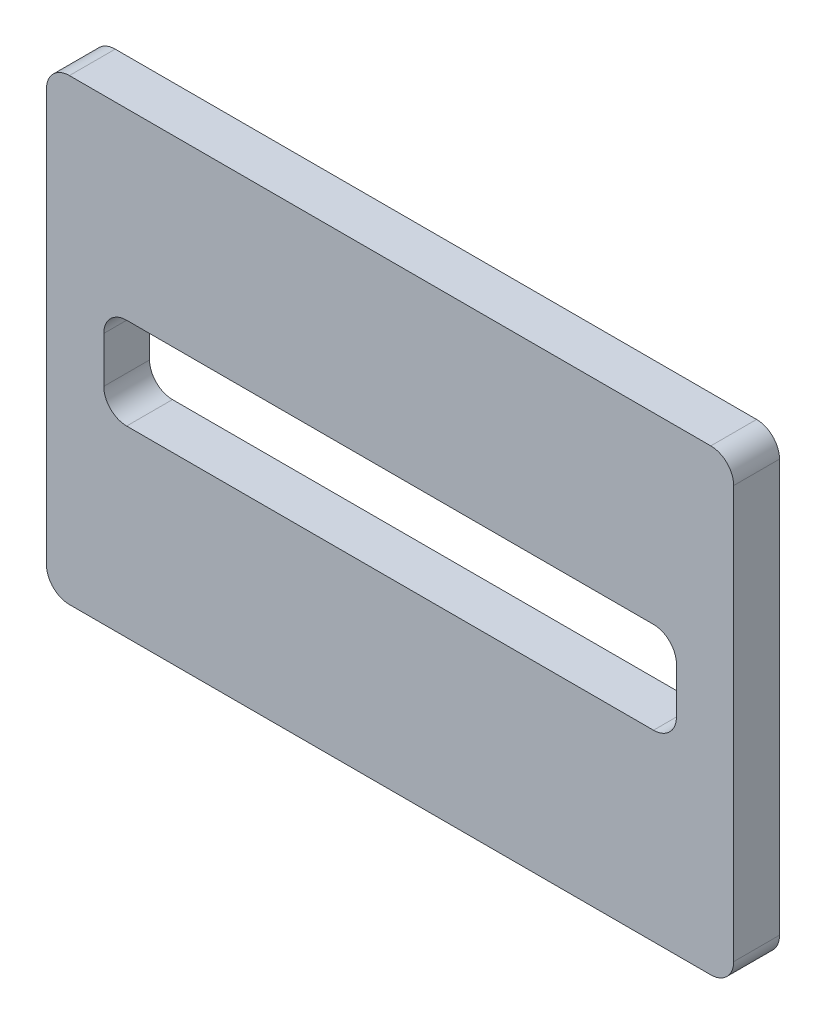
ISO-10303-21;
HEADER;
FILE_DESCRIPTION(('STEP AP214'),'2;1');
FILE_NAME('part.step','',(''),(''),'','','');
FILE_SCHEMA(('AUTOMOTIVE_DESIGN { 1 0 10303 214 1 1 1 1 }'));
ENDSEC;
DATA;
#1=APPLICATION_CONTEXT('core data for automotive mechanical design processes');
#2=APPLICATION_PROTOCOL_DEFINITION('international standard','automotive_design',2000,#1);
#3=PRODUCT_CONTEXT('',#1,'mechanical');
#4=PRODUCT('Part','Part','',(#3));
#5=PRODUCT_RELATED_PRODUCT_CATEGORY('part','',(#4));
#6=PRODUCT_DEFINITION_FORMATION('','',#4);
#7=PRODUCT_DEFINITION_CONTEXT('part definition',#1,'design');
#8=PRODUCT_DEFINITION('design','',#6,#7);
#9=PRODUCT_DEFINITION_SHAPE('','',#8);
#10=(LENGTH_UNIT() NAMED_UNIT(*) SI_UNIT(.MILLI.,.METRE.));
#11=(NAMED_UNIT(*) PLANE_ANGLE_UNIT() SI_UNIT($,.RADIAN.));
#12=(NAMED_UNIT(*) SI_UNIT($,.STERADIAN.) SOLID_ANGLE_UNIT());
#13=UNCERTAINTY_MEASURE_WITH_UNIT(LENGTH_MEASURE(1.E-05),#10,'distance_accuracy_value','');
#14=(GEOMETRIC_REPRESENTATION_CONTEXT(3) GLOBAL_UNCERTAINTY_ASSIGNED_CONTEXT((#13)) GLOBAL_UNIT_ASSIGNED_CONTEXT((#10,
#11,#12)) REPRESENTATION_CONTEXT('',''));
#15=CARTESIAN_POINT('',(0.,0.,0.));
#16=DIRECTION('',(0.,0.,1.));
#17=DIRECTION('',(1.,0.,0.));
#18=AXIS2_PLACEMENT_3D('',#15,#16,#17);
#19=CARTESIAN_POINT('',(0.,0.,20.));
#20=DIRECTION('',(1.,0.,0.));
#21=DIRECTION('',(0.,0.,-1.));
#22=AXIS2_PLACEMENT_3D('',#19,#20,#21);
#23=PLANE('',#22);
#24=DIRECTION('',(0.,-1.,0.));
#25=VECTOR('',#24,1.);
#26=CARTESIAN_POINT('',(0.,0.,20.));
#27=LINE('',#26,#25);
#28=CARTESIAN_POINT('',(0.,190.,20.));
#29=VERTEX_POINT('',#28);
#30=CARTESIAN_POINT('',(0.,10.,20.));
#31=VERTEX_POINT('',#30);
#32=EDGE_CURVE('E277',#29,#31,#27,.T.);
#33=ORIENTED_EDGE('',*,*,#32,.F.);
#34=DIRECTION('',(0.,0.,-1.));
#35=VECTOR('',#34,1.);
#36=CARTESIAN_POINT('',(0.,190.,20.));
#37=LINE('',#36,#35);
#38=CARTESIAN_POINT('',(0.,190.,0.));
#39=VERTEX_POINT('',#38);
#40=EDGE_CURVE('E333',#29,#39,#37,.T.);
#41=ORIENTED_EDGE('',*,*,#40,.T.);
#42=DIRECTION('',(0.,-1.,0.));
#43=VECTOR('',#42,1.);
#44=CARTESIAN_POINT('',(0.,0.,0.));
#45=LINE('',#44,#43);
#46=CARTESIAN_POINT('',(0.,10.,0.));
#47=VERTEX_POINT('',#46);
#48=EDGE_CURVE('E241',#39,#47,#45,.T.);
#49=ORIENTED_EDGE('',*,*,#48,.T.);
#50=DIRECTION('',(0.,0.,-1.));
#51=VECTOR('',#50,1.);
#52=CARTESIAN_POINT('',(0.,10.,20.));
#53=LINE('',#52,#51);
#54=EDGE_CURVE('E331',#47,#31,#53,.F.);
#55=ORIENTED_EDGE('',*,*,#54,.T.);
#56=EDGE_LOOP('',(#33,#41,#49,#55));
#57=FACE_BOUND('',#56,.T.);
#58=ADVANCED_FACE('F37',(#57),#23,.F.);
#59=CARTESIAN_POINT('',(0.,0.,20.));
#60=DIRECTION('',(0.,1.,0.));
#61=DIRECTION('',(0.,0.,1.));
#62=AXIS2_PLACEMENT_3D('',#59,#60,#61);
#63=PLANE('',#62);
#64=DIRECTION('',(1.,0.,0.));
#65=VECTOR('',#64,1.);
#66=CARTESIAN_POINT('',(0.,0.,0.));
#67=LINE('',#66,#65);
#68=CARTESIAN_POINT('',(10.,0.,0.));
#69=VERTEX_POINT('',#68);
#70=CARTESIAN_POINT('',(290.,0.,0.));
#71=VERTEX_POINT('',#70);
#72=EDGE_CURVE('E293',#69,#71,#67,.T.);
#73=ORIENTED_EDGE('',*,*,#72,.T.);
#74=DIRECTION('',(0.,0.,-1.));
#75=VECTOR('',#74,1.);
#76=CARTESIAN_POINT('',(290.,0.,20.));
#77=LINE('',#76,#75);
#78=CARTESIAN_POINT('',(290.,0.,20.));
#79=VERTEX_POINT('',#78);
#80=EDGE_CURVE('E316',#71,#79,#77,.F.);
#81=ORIENTED_EDGE('',*,*,#80,.T.);
#82=DIRECTION('',(1.,0.,0.));
#83=VECTOR('',#82,1.);
#84=CARTESIAN_POINT('',(0.,0.,20.));
#85=LINE('',#84,#83);
#86=CARTESIAN_POINT('',(10.,0.,20.));
#87=VERTEX_POINT('',#86);
#88=EDGE_CURVE('E280',#87,#79,#85,.T.);
#89=ORIENTED_EDGE('',*,*,#88,.F.);
#90=DIRECTION('',(0.,0.,-1.));
#91=VECTOR('',#90,1.);
#92=CARTESIAN_POINT('',(10.,0.,20.));
#93=LINE('',#92,#91);
#94=EDGE_CURVE('E313',#87,#69,#93,.T.);
#95=ORIENTED_EDGE('',*,*,#94,.T.);
#96=EDGE_LOOP('',(#73,#81,#89,#95));
#97=FACE_BOUND('',#96,.T.);
#98=ADVANCED_FACE('F429',(#97),#63,.F.);
#99=CARTESIAN_POINT('',(300.,0.,20.));
#100=DIRECTION('',(-1.,0.,0.));
#101=DIRECTION('',(0.,0.,1.));
#102=AXIS2_PLACEMENT_3D('',#99,#100,#101);
#103=PLANE('',#102);
#104=DIRECTION('',(0.,1.,0.));
#105=VECTOR('',#104,1.);
#106=CARTESIAN_POINT('',(300.,0.,20.));
#107=LINE('',#106,#105);
#108=CARTESIAN_POINT('',(300.,10.,20.));
#109=VERTEX_POINT('',#108);
#110=CARTESIAN_POINT('',(300.,190.,20.));
#111=VERTEX_POINT('',#110);
#112=EDGE_CURVE('E284',#109,#111,#107,.T.);
#113=ORIENTED_EDGE('',*,*,#112,.F.);
#114=DIRECTION('',(0.,0.,-1.));
#115=VECTOR('',#114,1.);
#116=CARTESIAN_POINT('',(300.,10.,20.));
#117=LINE('',#116,#115);
#118=CARTESIAN_POINT('',(300.,10.,0.));
#119=VERTEX_POINT('',#118);
#120=EDGE_CURVE('E302',#109,#119,#117,.T.);
#121=ORIENTED_EDGE('',*,*,#120,.T.);
#122=DIRECTION('',(0.,1.,0.));
#123=VECTOR('',#122,1.);
#124=CARTESIAN_POINT('',(300.,0.,0.));
#125=LINE('',#124,#123);
#126=CARTESIAN_POINT('',(300.,190.,0.));
#127=VERTEX_POINT('',#126);
#128=EDGE_CURVE('E296',#119,#127,#125,.T.);
#129=ORIENTED_EDGE('',*,*,#128,.T.);
#130=DIRECTION('',(0.,0.,-1.));
#131=VECTOR('',#130,1.);
#132=CARTESIAN_POINT('',(300.,190.,20.));
#133=LINE('',#132,#131);
#134=EDGE_CURVE('E290',#127,#111,#133,.F.);
#135=ORIENTED_EDGE('',*,*,#134,.T.);
#136=EDGE_LOOP('',(#113,#121,#129,#135));
#137=FACE_BOUND('',#136,.T.);
#138=ADVANCED_FACE('F435',(#137),#103,.F.);
#139=CARTESIAN_POINT('',(0.,200.,20.));
#140=DIRECTION('',(0.,-1.,0.));
#141=DIRECTION('',(0.,0.,-1.));
#142=AXIS2_PLACEMENT_3D('',#139,#140,#141);
#143=PLANE('',#142);
#144=DIRECTION('',(-1.,0.,0.));
#145=VECTOR('',#144,1.);
#146=CARTESIAN_POINT('',(0.,200.,20.));
#147=LINE('',#146,#145);
#148=CARTESIAN_POINT('',(290.,200.,20.));
#149=VERTEX_POINT('',#148);
#150=CARTESIAN_POINT('',(10.,200.,20.));
#151=VERTEX_POINT('',#150);
#152=EDGE_CURVE('E287',#149,#151,#147,.T.);
#153=ORIENTED_EDGE('',*,*,#152,.F.);
#154=DIRECTION('',(0.,0.,-1.));
#155=VECTOR('',#154,1.);
#156=CARTESIAN_POINT('',(290.,200.,20.));
#157=LINE('',#156,#155);
#158=CARTESIAN_POINT('',(290.,200.,0.));
#159=VERTEX_POINT('',#158);
#160=EDGE_CURVE('E328',#149,#159,#157,.T.);
#161=ORIENTED_EDGE('',*,*,#160,.T.);
#162=DIRECTION('',(-1.,0.,0.));
#163=VECTOR('',#162,1.);
#164=CARTESIAN_POINT('',(0.,200.,0.));
#165=LINE('',#164,#163);
#166=CARTESIAN_POINT('',(10.,200.,0.));
#167=VERTEX_POINT('',#166);
#168=EDGE_CURVE('E281',#159,#167,#165,.T.);
#169=ORIENTED_EDGE('',*,*,#168,.T.);
#170=DIRECTION('',(0.,0.,-1.));
#171=VECTOR('',#170,1.);
#172=CARTESIAN_POINT('',(10.,200.,20.));
#173=LINE('',#172,#171);
#174=EDGE_CURVE('E326',#167,#151,#173,.F.);
#175=ORIENTED_EDGE('',*,*,#174,.T.);
#176=EDGE_LOOP('',(#153,#161,#169,#175));
#177=FACE_BOUND('',#176,.T.);
#178=ADVANCED_FACE('F526',(#177),#143,.F.);
#179=CARTESIAN_POINT('',(0.,0.,20.));
#180=DIRECTION('',(0.,0.,-1.));
#181=DIRECTION('',(-1.,0.,0.));
#182=AXIS2_PLACEMENT_3D('',#179,#180,#181);
#183=PLANE('',#182);
#184=DIRECTION('',(0.,-1.,0.));
#185=VECTOR('',#184,1.);
#186=CARTESIAN_POINT('',(275.,120.,20.));
#187=LINE('',#186,#185);
#188=CARTESIAN_POINT('',(275.,110.,20.));
#189=VERTEX_POINT('',#188);
#190=CARTESIAN_POINT('',(275.,90.,20.));
#191=VERTEX_POINT('',#190);
#192=EDGE_CURVE('E385',#189,#191,#187,.T.);
#193=ORIENTED_EDGE('',*,*,#192,.T.);
#194=CARTESIAN_POINT('',(265.,90.,20.));
#195=DIRECTION('',(0.,0.,-1.));
#196=DIRECTION('',(-1.,0.,0.));
#197=AXIS2_PLACEMENT_3D('',#194,#195,#196);
#198=CIRCLE('',#197,10.);
#199=CARTESIAN_POINT('',(265.,80.,20.));
#200=VERTEX_POINT('',#199);
#201=EDGE_CURVE('E365',#191,#200,#198,.T.);
#202=ORIENTED_EDGE('',*,*,#201,.T.);
#203=DIRECTION('',(-1.,0.,0.));
#204=VECTOR('',#203,1.);
#205=CARTESIAN_POINT('',(24.9999999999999,80.,20.));
#206=LINE('',#205,#204);
#207=CARTESIAN_POINT('',(34.9999999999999,80.,20.));
#208=VERTEX_POINT('',#207);
#209=EDGE_CURVE('E262',#200,#208,#206,.T.);
#210=ORIENTED_EDGE('',*,*,#209,.T.);
#211=CARTESIAN_POINT('',(34.9999999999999,90.,20.));
#212=DIRECTION('',(0.,0.,-1.));
#213=DIRECTION('',(-1.,0.,0.));
#214=AXIS2_PLACEMENT_3D('',#211,#212,#213);
#215=CIRCLE('',#214,10.);
#216=CARTESIAN_POINT('',(24.9999999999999,90.,20.));
#217=VERTEX_POINT('',#216);
#218=EDGE_CURVE('E357',#208,#217,#215,.T.);
#219=ORIENTED_EDGE('',*,*,#218,.T.);
#220=DIRECTION('',(0.,1.,0.));
#221=VECTOR('',#220,1.);
#222=CARTESIAN_POINT('',(24.9999999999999,120.,20.));
#223=LINE('',#222,#221);
#224=CARTESIAN_POINT('',(24.9999999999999,110.,20.));
#225=VERTEX_POINT('',#224);
#226=EDGE_CURVE('E391',#217,#225,#223,.T.);
#227=ORIENTED_EDGE('',*,*,#226,.T.);
#228=CARTESIAN_POINT('',(34.9999999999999,110.,20.));
#229=DIRECTION('',(0.,0.,-1.));
#230=DIRECTION('',(-1.,0.,0.));
#231=AXIS2_PLACEMENT_3D('',#228,#229,#230);
#232=CIRCLE('',#231,10.);
#233=CARTESIAN_POINT('',(34.9999999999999,120.,20.));
#234=VERTEX_POINT('',#233);
#235=EDGE_CURVE('E361',#225,#234,#232,.T.);
#236=ORIENTED_EDGE('',*,*,#235,.T.);
#237=DIRECTION('',(1.,0.,0.));
#238=VECTOR('',#237,1.);
#239=CARTESIAN_POINT('',(24.9999999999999,120.,20.));
#240=LINE('',#239,#238);
#241=CARTESIAN_POINT('',(265.,120.,20.));
#242=VERTEX_POINT('',#241);
#243=EDGE_CURVE('E387',#234,#242,#240,.T.);
#244=ORIENTED_EDGE('',*,*,#243,.T.);
#245=CARTESIAN_POINT('',(265.,110.,20.));
#246=DIRECTION('',(0.,0.,-1.));
#247=DIRECTION('',(-1.,0.,0.));
#248=AXIS2_PLACEMENT_3D('',#245,#246,#247);
#249=CIRCLE('',#248,10.);
#250=EDGE_CURVE('E11',#242,#189,#249,.T.);
#251=ORIENTED_EDGE('',*,*,#250,.T.);
#252=EDGE_LOOP('',(#193,#202,#210,#219,#227,#236,#244,#251));
#253=FACE_BOUND('',#252,.T.);
#254=ORIENTED_EDGE('',*,*,#88,.T.);
#255=CARTESIAN_POINT('',(290.,10.,20.));
#256=DIRECTION('',(0.,0.,-1.));
#257=DIRECTION('',(-1.,0.,0.));
#258=AXIS2_PLACEMENT_3D('',#255,#256,#257);
#259=CIRCLE('',#258,10.);
#260=EDGE_CURVE('E324',#79,#109,#259,.F.);
#261=ORIENTED_EDGE('',*,*,#260,.T.);
#262=ORIENTED_EDGE('',*,*,#112,.T.);
#263=CARTESIAN_POINT('',(290.,190.,20.));
#264=DIRECTION('',(0.,0.,-1.));
#265=DIRECTION('',(-1.,0.,0.));
#266=AXIS2_PLACEMENT_3D('',#263,#264,#265);
#267=CIRCLE('',#266,10.);
#268=EDGE_CURVE('E322',#111,#149,#267,.F.);
#269=ORIENTED_EDGE('',*,*,#268,.T.);
#270=ORIENTED_EDGE('',*,*,#152,.T.);
#271=CARTESIAN_POINT('',(10.,190.,20.));
#272=DIRECTION('',(0.,0.,-1.));
#273=DIRECTION('',(-1.,0.,0.));
#274=AXIS2_PLACEMENT_3D('',#271,#272,#273);
#275=CIRCLE('',#274,10.);
#276=EDGE_CURVE('E320',#151,#29,#275,.F.);
#277=ORIENTED_EDGE('',*,*,#276,.T.);
#278=ORIENTED_EDGE('',*,*,#32,.T.);
#279=CARTESIAN_POINT('',(10.,10.,20.));
#280=DIRECTION('',(0.,0.,-1.));
#281=DIRECTION('',(-1.,0.,0.));
#282=AXIS2_PLACEMENT_3D('',#279,#280,#281);
#283=CIRCLE('',#282,10.);
#284=EDGE_CURVE('E318',#31,#87,#283,.F.);
#285=ORIENTED_EDGE('',*,*,#284,.T.);
#286=EDGE_LOOP('',(#254,#261,#262,#269,#270,#277,#278,#285));
#287=FACE_BOUND('',#286,.T.);
#288=ADVANCED_FACE('F403',(#253,#287),#183,.F.);
#289=CARTESIAN_POINT('',(0.,0.,0.));
#290=DIRECTION('',(0.,0.,-1.));
#291=DIRECTION('',(-1.,0.,0.));
#292=AXIS2_PLACEMENT_3D('',#289,#290,#291);
#293=PLANE('',#292);
#294=DIRECTION('',(0.,1.,0.));
#295=VECTOR('',#294,1.);
#296=CARTESIAN_POINT('',(24.9999999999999,120.,0.));
#297=LINE('',#296,#295);
#298=CARTESIAN_POINT('',(24.9999999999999,90.,0.));
#299=VERTEX_POINT('',#298);
#300=CARTESIAN_POINT('',(24.9999999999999,110.,0.));
#301=VERTEX_POINT('',#300);
#302=EDGE_CURVE('E382',#299,#301,#297,.T.);
#303=ORIENTED_EDGE('',*,*,#302,.F.);
#304=CARTESIAN_POINT('',(34.9999999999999,90.,0.));
#305=DIRECTION('',(0.,0.,-1.));
#306=DIRECTION('',(-1.,0.,0.));
#307=AXIS2_PLACEMENT_3D('',#304,#305,#306);
#308=CIRCLE('',#307,10.);
#309=CARTESIAN_POINT('',(34.9999999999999,80.,0.));
#310=VERTEX_POINT('',#309);
#311=EDGE_CURVE('E355',#299,#310,#308,.F.);
#312=ORIENTED_EDGE('',*,*,#311,.T.);
#313=DIRECTION('',(-1.,0.,0.));
#314=VECTOR('',#313,1.);
#315=CARTESIAN_POINT('',(24.9999999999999,80.,0.));
#316=LINE('',#315,#314);
#317=CARTESIAN_POINT('',(265.,80.,0.));
#318=VERTEX_POINT('',#317);
#319=EDGE_CURVE('E228',#318,#310,#316,.T.);
#320=ORIENTED_EDGE('',*,*,#319,.F.);
#321=CARTESIAN_POINT('',(265.,90.,0.));
#322=DIRECTION('',(0.,0.,-1.));
#323=DIRECTION('',(-1.,0.,0.));
#324=AXIS2_PLACEMENT_3D('',#321,#322,#323);
#325=CIRCLE('',#324,10.);
#326=CARTESIAN_POINT('',(275.,90.,0.));
#327=VERTEX_POINT('',#326);
#328=EDGE_CURVE('E363',#318,#327,#325,.F.);
#329=ORIENTED_EDGE('',*,*,#328,.T.);
#330=DIRECTION('',(0.,-1.,0.));
#331=VECTOR('',#330,1.);
#332=CARTESIAN_POINT('',(275.,120.,0.));
#333=LINE('',#332,#331);
#334=CARTESIAN_POINT('',(275.,110.,0.));
#335=VERTEX_POINT('',#334);
#336=EDGE_CURVE('E374',#335,#327,#333,.T.);
#337=ORIENTED_EDGE('',*,*,#336,.F.);
#338=CARTESIAN_POINT('',(265.,110.,0.));
#339=DIRECTION('',(0.,0.,-1.));
#340=DIRECTION('',(-1.,0.,0.));
#341=AXIS2_PLACEMENT_3D('',#338,#339,#340);
#342=CIRCLE('',#341,10.);
#343=CARTESIAN_POINT('',(265.,120.,0.));
#344=VERTEX_POINT('',#343);
#345=EDGE_CURVE('E45',#335,#344,#342,.F.);
#346=ORIENTED_EDGE('',*,*,#345,.T.);
#347=DIRECTION('',(1.,0.,0.));
#348=VECTOR('',#347,1.);
#349=CARTESIAN_POINT('',(24.9999999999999,120.,0.));
#350=LINE('',#349,#348);
#351=CARTESIAN_POINT('',(34.9999999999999,120.,0.));
#352=VERTEX_POINT('',#351);
#353=EDGE_CURVE('E373',#352,#344,#350,.T.);
#354=ORIENTED_EDGE('',*,*,#353,.F.);
#355=CARTESIAN_POINT('',(34.9999999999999,110.,0.));
#356=DIRECTION('',(0.,0.,-1.));
#357=DIRECTION('',(-1.,0.,0.));
#358=AXIS2_PLACEMENT_3D('',#355,#356,#357);
#359=CIRCLE('',#358,10.);
#360=EDGE_CURVE('E359',#352,#301,#359,.F.);
#361=ORIENTED_EDGE('',*,*,#360,.T.);
#362=EDGE_LOOP('',(#303,#312,#320,#329,#337,#346,#354,#361));
#363=FACE_BOUND('',#362,.T.);
#364=DIRECTION('',(0.,1.,0.));
#365=VECTOR('',#364,1.);
#366=CARTESIAN_POINT('',(25.,30.,0.));
#367=LINE('',#366,#365);
#368=CARTESIAN_POINT('',(25.,30.,0.));
#369=VERTEX_POINT('',#368);
#370=CARTESIAN_POINT('',(25.,41.,0.));
#371=VERTEX_POINT('',#370);
#372=EDGE_CURVE('E205',#369,#371,#367,.T.);
#373=ORIENTED_EDGE('',*,*,#372,.F.);
#374=DIRECTION('',(-1.,0.,0.));
#375=VECTOR('',#374,1.);
#376=CARTESIAN_POINT('',(25.,30.,0.));
#377=LINE('',#376,#375);
#378=CARTESIAN_POINT('',(275.,30.,0.));
#379=VERTEX_POINT('',#378);
#380=EDGE_CURVE('E222',#379,#369,#377,.T.);
#381=ORIENTED_EDGE('',*,*,#380,.F.);
#382=DIRECTION('',(0.,-1.,0.));
#383=VECTOR('',#382,1.);
#384=CARTESIAN_POINT('',(275.,30.,0.));
#385=LINE('',#384,#383);
#386=CARTESIAN_POINT('',(275.,41.,0.));
#387=VERTEX_POINT('',#386);
#388=EDGE_CURVE('E225',#387,#379,#385,.T.);
#389=ORIENTED_EDGE('',*,*,#388,.F.);
#390=DIRECTION('',(1.,0.,0.));
#391=VECTOR('',#390,1.);
#392=CARTESIAN_POINT('',(25.,41.,0.));
#393=LINE('',#392,#391);
#394=EDGE_CURVE('E234',#371,#387,#393,.T.);
#395=ORIENTED_EDGE('',*,*,#394,.F.);
#396=EDGE_LOOP('',(#373,#381,#389,#395));
#397=FACE_BOUND('',#396,.T.);
#398=DIRECTION('',(0.,1.,0.));
#399=VECTOR('',#398,1.);
#400=CARTESIAN_POINT('',(25.,170.,0.));
#401=LINE('',#400,#399);
#402=CARTESIAN_POINT('',(25.,159.,0.));
#403=VERTEX_POINT('',#402);
#404=CARTESIAN_POINT('',(25.,170.,0.));
#405=VERTEX_POINT('',#404);
#406=EDGE_CURVE('E259',#403,#405,#401,.T.);
#407=ORIENTED_EDGE('',*,*,#406,.F.);
#408=DIRECTION('',(-1.,0.,0.));
#409=VECTOR('',#408,1.);
#410=CARTESIAN_POINT('',(25.,159.,0.));
#411=LINE('',#410,#409);
#412=CARTESIAN_POINT('',(275.,159.,0.));
#413=VERTEX_POINT('',#412);
#414=EDGE_CURVE('E249',#413,#403,#411,.T.);
#415=ORIENTED_EDGE('',*,*,#414,.F.);
#416=DIRECTION('',(0.,-1.,0.));
#417=VECTOR('',#416,1.);
#418=CARTESIAN_POINT('',(275.,170.,0.));
#419=LINE('',#418,#417);
#420=CARTESIAN_POINT('',(275.,170.,0.));
#421=VERTEX_POINT('',#420);
#422=EDGE_CURVE('E265',#421,#413,#419,.T.);
#423=ORIENTED_EDGE('',*,*,#422,.F.);
#424=DIRECTION('',(1.,0.,0.));
#425=VECTOR('',#424,1.);
#426=CARTESIAN_POINT('',(25.,170.,0.));
#427=LINE('',#426,#425);
#428=EDGE_CURVE('E261',#405,#421,#427,.T.);
#429=ORIENTED_EDGE('',*,*,#428,.F.);
#430=EDGE_LOOP('',(#407,#415,#423,#429));
#431=FACE_BOUND('',#430,.T.);
#432=ORIENTED_EDGE('',*,*,#128,.F.);
#433=CARTESIAN_POINT('',(290.,10.,0.));
#434=DIRECTION('',(0.,0.,-1.));
#435=DIRECTION('',(-1.,0.,0.));
#436=AXIS2_PLACEMENT_3D('',#433,#434,#435);
#437=CIRCLE('',#436,10.);
#438=EDGE_CURVE('E311',#119,#71,#437,.T.);
#439=ORIENTED_EDGE('',*,*,#438,.T.);
#440=ORIENTED_EDGE('',*,*,#72,.F.);
#441=CARTESIAN_POINT('',(10.,10.,0.));
#442=DIRECTION('',(0.,0.,-1.));
#443=DIRECTION('',(-1.,0.,0.));
#444=AXIS2_PLACEMENT_3D('',#441,#442,#443);
#445=CIRCLE('',#444,10.);
#446=EDGE_CURVE('E305',#69,#47,#445,.T.);
#447=ORIENTED_EDGE('',*,*,#446,.T.);
#448=ORIENTED_EDGE('',*,*,#48,.F.);
#449=CARTESIAN_POINT('',(10.,190.,0.));
#450=DIRECTION('',(0.,0.,-1.));
#451=DIRECTION('',(-1.,0.,0.));
#452=AXIS2_PLACEMENT_3D('',#449,#450,#451);
#453=CIRCLE('',#452,10.);
#454=EDGE_CURVE('E307',#39,#167,#453,.T.);
#455=ORIENTED_EDGE('',*,*,#454,.T.);
#456=ORIENTED_EDGE('',*,*,#168,.F.);
#457=CARTESIAN_POINT('',(290.,190.,0.));
#458=DIRECTION('',(0.,0.,-1.));
#459=DIRECTION('',(-1.,0.,0.));
#460=AXIS2_PLACEMENT_3D('',#457,#458,#459);
#461=CIRCLE('',#460,10.);
#462=EDGE_CURVE('E309',#159,#127,#461,.T.);
#463=ORIENTED_EDGE('',*,*,#462,.T.);
#464=EDGE_LOOP('',(#432,#439,#440,#447,#448,#455,#456,#463));
#465=FACE_BOUND('',#464,.T.);
#466=ADVANCED_FACE('F371',(#363,#397,#431,#465),#293,.T.);
#467=CARTESIAN_POINT('',(25.,170.,3.));
#468=DIRECTION('',(-1.,0.,0.));
#469=DIRECTION('',(0.,0.,1.));
#470=AXIS2_PLACEMENT_3D('',#467,#468,#469);
#471=PLANE('',#470);
#472=ORIENTED_EDGE('',*,*,#406,.T.);
#473=DIRECTION('',(0.,0.,-1.));
#474=VECTOR('',#473,1.);
#475=CARTESIAN_POINT('',(25.,170.,3.));
#476=LINE('',#475,#474);
#477=CARTESIAN_POINT('',(25.,170.,3.));
#478=VERTEX_POINT('',#477);
#479=EDGE_CURVE('E258',#478,#405,#476,.T.);
#480=ORIENTED_EDGE('',*,*,#479,.F.);
#481=DIRECTION('',(0.,1.,0.));
#482=VECTOR('',#481,1.);
#483=CARTESIAN_POINT('',(25.,170.,3.));
#484=LINE('',#483,#482);
#485=CARTESIAN_POINT('',(25.,159.,3.));
#486=VERTEX_POINT('',#485);
#487=EDGE_CURVE('E245',#486,#478,#484,.T.);
#488=ORIENTED_EDGE('',*,*,#487,.F.);
#489=DIRECTION('',(0.,0.,-1.));
#490=VECTOR('',#489,1.);
#491=CARTESIAN_POINT('',(25.,159.,3.));
#492=LINE('',#491,#490);
#493=EDGE_CURVE('E235',#486,#403,#492,.T.);
#494=ORIENTED_EDGE('',*,*,#493,.T.);
#495=EDGE_LOOP('',(#472,#480,#488,#494));
#496=FACE_BOUND('',#495,.T.);
#497=ADVANCED_FACE('F515',(#496),#471,.F.);
#498=CARTESIAN_POINT('',(25.,159.,3.));
#499=DIRECTION('',(0.,-1.,0.));
#500=DIRECTION('',(1.,0.,0.));
#501=AXIS2_PLACEMENT_3D('',#498,#499,#500);
#502=PLANE('',#501);
#503=ORIENTED_EDGE('',*,*,#414,.T.);
#504=ORIENTED_EDGE('',*,*,#493,.F.);
#505=DIRECTION('',(-1.,0.,0.));
#506=VECTOR('',#505,1.);
#507=CARTESIAN_POINT('',(25.,159.,3.));
#508=LINE('',#507,#506);
#509=CARTESIAN_POINT('',(275.,159.,3.));
#510=VERTEX_POINT('',#509);
#511=EDGE_CURVE('E255',#510,#486,#508,.T.);
#512=ORIENTED_EDGE('',*,*,#511,.F.);
#513=DIRECTION('',(0.,0.,-1.));
#514=VECTOR('',#513,1.);
#515=CARTESIAN_POINT('',(275.,159.,3.));
#516=LINE('',#515,#514);
#517=EDGE_CURVE('E271',#510,#413,#516,.T.);
#518=ORIENTED_EDGE('',*,*,#517,.T.);
#519=EDGE_LOOP('',(#503,#504,#512,#518));
#520=FACE_BOUND('',#519,.T.);
#521=ADVANCED_FACE('F650',(#520),#502,.F.);
#522=CARTESIAN_POINT('',(275.,170.,3.));
#523=DIRECTION('',(1.,0.,0.));
#524=DIRECTION('',(0.,0.,-1.));
#525=AXIS2_PLACEMENT_3D('',#522,#523,#524);
#526=PLANE('',#525);
#527=ORIENTED_EDGE('',*,*,#422,.T.);
#528=ORIENTED_EDGE('',*,*,#517,.F.);
#529=DIRECTION('',(0.,-1.,0.));
#530=VECTOR('',#529,1.);
#531=CARTESIAN_POINT('',(275.,170.,3.));
#532=LINE('',#531,#530);
#533=CARTESIAN_POINT('',(275.,170.,3.));
#534=VERTEX_POINT('',#533);
#535=EDGE_CURVE('E252',#534,#510,#532,.T.);
#536=ORIENTED_EDGE('',*,*,#535,.F.);
#537=DIRECTION('',(0.,0.,-1.));
#538=VECTOR('',#537,1.);
#539=CARTESIAN_POINT('',(275.,170.,3.));
#540=LINE('',#539,#538);
#541=EDGE_CURVE('E273',#534,#421,#540,.T.);
#542=ORIENTED_EDGE('',*,*,#541,.T.);
#543=EDGE_LOOP('',(#527,#528,#536,#542));
#544=FACE_BOUND('',#543,.T.);
#545=ADVANCED_FACE('F640',(#544),#526,.F.);
#546=CARTESIAN_POINT('',(25.,170.,3.));
#547=DIRECTION('',(0.,1.,0.));
#548=DIRECTION('',(-1.,0.,0.));
#549=AXIS2_PLACEMENT_3D('',#546,#547,#548);
#550=PLANE('',#549);
#551=ORIENTED_EDGE('',*,*,#428,.T.);
#552=ORIENTED_EDGE('',*,*,#541,.F.);
#553=DIRECTION('',(1.,0.,0.));
#554=VECTOR('',#553,1.);
#555=CARTESIAN_POINT('',(25.,170.,3.));
#556=LINE('',#555,#554);
#557=EDGE_CURVE('E248',#478,#534,#556,.T.);
#558=ORIENTED_EDGE('',*,*,#557,.F.);
#559=ORIENTED_EDGE('',*,*,#479,.T.);
#560=EDGE_LOOP('',(#551,#552,#558,#559));
#561=FACE_BOUND('',#560,.T.);
#562=ADVANCED_FACE('F630',(#561),#550,.F.);
#563=CARTESIAN_POINT('',(0.,0.,3.));
#564=DIRECTION('',(0.,0.,1.));
#565=DIRECTION('',(1.,0.,0.));
#566=AXIS2_PLACEMENT_3D('',#563,#564,#565);
#567=PLANE('',#566);
#568=ORIENTED_EDGE('',*,*,#487,.T.);
#569=ORIENTED_EDGE('',*,*,#557,.T.);
#570=ORIENTED_EDGE('',*,*,#535,.T.);
#571=ORIENTED_EDGE('',*,*,#511,.T.);
#572=EDGE_LOOP('',(#568,#569,#570,#571));
#573=FACE_BOUND('',#572,.T.);
#574=ADVANCED_FACE('F621',(#573),#567,.F.);
#575=CARTESIAN_POINT('',(25.,30.,3.));
#576=DIRECTION('',(-1.,0.,0.));
#577=DIRECTION('',(0.,0.,1.));
#578=AXIS2_PLACEMENT_3D('',#575,#576,#577);
#579=PLANE('',#578);
#580=ORIENTED_EDGE('',*,*,#372,.T.);
#581=DIRECTION('',(0.,0.,-1.));
#582=VECTOR('',#581,1.);
#583=CARTESIAN_POINT('',(25.,41.,3.));
#584=LINE('',#583,#582);
#585=CARTESIAN_POINT('',(25.,41.,3.));
#586=VERTEX_POINT('',#585);
#587=EDGE_CURVE('E198',#586,#371,#584,.T.);
#588=ORIENTED_EDGE('',*,*,#587,.F.);
#589=DIRECTION('',(0.,1.,0.));
#590=VECTOR('',#589,1.);
#591=CARTESIAN_POINT('',(25.,30.,3.));
#592=LINE('',#591,#590);
#593=CARTESIAN_POINT('',(25.,30.,3.));
#594=VERTEX_POINT('',#593);
#595=EDGE_CURVE('E202',#594,#586,#592,.T.);
#596=ORIENTED_EDGE('',*,*,#595,.F.);
#597=DIRECTION('',(0.,0.,-1.));
#598=VECTOR('',#597,1.);
#599=CARTESIAN_POINT('',(25.,30.,3.));
#600=LINE('',#599,#598);
#601=EDGE_CURVE('E239',#594,#369,#600,.T.);
#602=ORIENTED_EDGE('',*,*,#601,.T.);
#603=EDGE_LOOP('',(#580,#588,#596,#602));
#604=FACE_BOUND('',#603,.T.);
#605=ADVANCED_FACE('F200',(#604),#579,.F.);
#606=CARTESIAN_POINT('',(25.,30.,3.));
#607=DIRECTION('',(0.,-1.,0.));
#608=DIRECTION('',(1.,0.,0.));
#609=AXIS2_PLACEMENT_3D('',#606,#607,#608);
#610=PLANE('',#609);
#611=ORIENTED_EDGE('',*,*,#380,.T.);
#612=ORIENTED_EDGE('',*,*,#601,.F.);
#613=DIRECTION('',(-1.,0.,0.));
#614=VECTOR('',#613,1.);
#615=CARTESIAN_POINT('',(25.,30.,3.));
#616=LINE('',#615,#614);
#617=CARTESIAN_POINT('',(275.,30.,3.));
#618=VERTEX_POINT('',#617);
#619=EDGE_CURVE('E210',#618,#594,#616,.T.);
#620=ORIENTED_EDGE('',*,*,#619,.F.);
#621=DIRECTION('',(0.,0.,-1.));
#622=VECTOR('',#621,1.);
#623=CARTESIAN_POINT('',(275.,30.,3.));
#624=LINE('',#623,#622);
#625=EDGE_CURVE('E242',#618,#379,#624,.T.);
#626=ORIENTED_EDGE('',*,*,#625,.T.);
#627=EDGE_LOOP('',(#611,#612,#620,#626));
#628=FACE_BOUND('',#627,.T.);
#629=ADVANCED_FACE('F602',(#628),#610,.F.);
#630=CARTESIAN_POINT('',(275.,30.,3.));
#631=DIRECTION('',(1.,0.,0.));
#632=DIRECTION('',(0.,0.,-1.));
#633=AXIS2_PLACEMENT_3D('',#630,#631,#632);
#634=PLANE('',#633);
#635=ORIENTED_EDGE('',*,*,#388,.T.);
#636=ORIENTED_EDGE('',*,*,#625,.F.);
#637=DIRECTION('',(0.,-1.,0.));
#638=VECTOR('',#637,1.);
#639=CARTESIAN_POINT('',(275.,30.,3.));
#640=LINE('',#639,#638);
#641=CARTESIAN_POINT('',(275.,41.,3.));
#642=VERTEX_POINT('',#641);
#643=EDGE_CURVE('E218',#642,#618,#640,.T.);
#644=ORIENTED_EDGE('',*,*,#643,.F.);
#645=DIRECTION('',(0.,0.,-1.));
#646=VECTOR('',#645,1.);
#647=CARTESIAN_POINT('',(275.,41.,3.));
#648=LINE('',#647,#646);
#649=EDGE_CURVE('E209',#642,#387,#648,.T.);
#650=ORIENTED_EDGE('',*,*,#649,.T.);
#651=EDGE_LOOP('',(#635,#636,#644,#650));
#652=FACE_BOUND('',#651,.T.);
#653=ADVANCED_FACE('F593',(#652),#634,.F.);
#654=CARTESIAN_POINT('',(25.,41.,3.));
#655=DIRECTION('',(0.,1.,0.));
#656=DIRECTION('',(-1.,0.,0.));
#657=AXIS2_PLACEMENT_3D('',#654,#655,#656);
#658=PLANE('',#657);
#659=ORIENTED_EDGE('',*,*,#394,.T.);
#660=ORIENTED_EDGE('',*,*,#649,.F.);
#661=DIRECTION('',(1.,0.,0.));
#662=VECTOR('',#661,1.);
#663=CARTESIAN_POINT('',(25.,41.,3.));
#664=LINE('',#663,#662);
#665=EDGE_CURVE('E213',#586,#642,#664,.T.);
#666=ORIENTED_EDGE('',*,*,#665,.F.);
#667=ORIENTED_EDGE('',*,*,#587,.T.);
#668=EDGE_LOOP('',(#659,#660,#666,#667));
#669=FACE_BOUND('',#668,.T.);
#670=ADVANCED_FACE('F214',(#669),#658,.F.);
#671=CARTESIAN_POINT('',(0.,0.,3.));
#672=DIRECTION('',(0.,0.,-1.));
#673=DIRECTION('',(-1.,0.,0.));
#674=AXIS2_PLACEMENT_3D('',#671,#672,#673);
#675=PLANE('',#674);
#676=ORIENTED_EDGE('',*,*,#595,.T.);
#677=ORIENTED_EDGE('',*,*,#665,.T.);
#678=ORIENTED_EDGE('',*,*,#643,.T.);
#679=ORIENTED_EDGE('',*,*,#619,.T.);
#680=EDGE_LOOP('',(#676,#677,#678,#679));
#681=FACE_BOUND('',#680,.T.);
#682=ADVANCED_FACE('F220',(#681),#675,.T.);
#683=CARTESIAN_POINT('',(290.,10.,20.));
#684=DIRECTION('',(0.,0.,-1.));
#685=DIRECTION('',(-1.,0.,0.));
#686=AXIS2_PLACEMENT_3D('',#683,#684,#685);
#687=CYLINDRICAL_SURFACE('',#686,10.);
#688=ORIENTED_EDGE('',*,*,#260,.F.);
#689=ORIENTED_EDGE('',*,*,#80,.F.);
#690=ORIENTED_EDGE('',*,*,#438,.F.);
#691=ORIENTED_EDGE('',*,*,#120,.F.);
#692=EDGE_LOOP('',(#688,#689,#690,#691));
#693=FACE_BOUND('',#692,.T.);
#694=ADVANCED_FACE('F441',(#693),#687,.T.);
#695=CARTESIAN_POINT('',(290.,190.,20.));
#696=DIRECTION('',(0.,0.,-1.));
#697=DIRECTION('',(-1.,0.,0.));
#698=AXIS2_PLACEMENT_3D('',#695,#696,#697);
#699=CYLINDRICAL_SURFACE('',#698,10.);
#700=ORIENTED_EDGE('',*,*,#268,.F.);
#701=ORIENTED_EDGE('',*,*,#134,.F.);
#702=ORIENTED_EDGE('',*,*,#462,.F.);
#703=ORIENTED_EDGE('',*,*,#160,.F.);
#704=EDGE_LOOP('',(#700,#701,#702,#703));
#705=FACE_BOUND('',#704,.T.);
#706=ADVANCED_FACE('F444',(#705),#699,.T.);
#707=CARTESIAN_POINT('',(10.,190.,20.));
#708=DIRECTION('',(0.,0.,-1.));
#709=DIRECTION('',(-1.,0.,0.));
#710=AXIS2_PLACEMENT_3D('',#707,#708,#709);
#711=CYLINDRICAL_SURFACE('',#710,10.);
#712=ORIENTED_EDGE('',*,*,#276,.F.);
#713=ORIENTED_EDGE('',*,*,#174,.F.);
#714=ORIENTED_EDGE('',*,*,#454,.F.);
#715=ORIENTED_EDGE('',*,*,#40,.F.);
#716=EDGE_LOOP('',(#712,#713,#714,#715));
#717=FACE_BOUND('',#716,.T.);
#718=ADVANCED_FACE('F448',(#717),#711,.T.);
#719=CARTESIAN_POINT('',(10.,10.,20.));
#720=DIRECTION('',(0.,0.,-1.));
#721=DIRECTION('',(-1.,0.,0.));
#722=AXIS2_PLACEMENT_3D('',#719,#720,#721);
#723=CYLINDRICAL_SURFACE('',#722,10.);
#724=ORIENTED_EDGE('',*,*,#284,.F.);
#725=ORIENTED_EDGE('',*,*,#54,.F.);
#726=ORIENTED_EDGE('',*,*,#446,.F.);
#727=ORIENTED_EDGE('',*,*,#94,.F.);
#728=EDGE_LOOP('',(#724,#725,#726,#727));
#729=FACE_BOUND('',#728,.T.);
#730=ADVANCED_FACE('F426',(#729),#723,.T.);
#731=CARTESIAN_POINT('',(24.9999999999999,120.,20.));
#732=DIRECTION('',(-1.,0.,0.));
#733=DIRECTION('',(0.,-1.,0.));
#734=AXIS2_PLACEMENT_3D('',#731,#732,#733);
#735=PLANE('',#734);
#736=ORIENTED_EDGE('',*,*,#226,.F.);
#737=DIRECTION('',(0.,0.,-1.));
#738=VECTOR('',#737,1.);
#739=CARTESIAN_POINT('',(24.9999999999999,90.,0.));
#740=LINE('',#739,#738);
#741=EDGE_CURVE('E338',#217,#299,#740,.T.);
#742=ORIENTED_EDGE('',*,*,#741,.T.);
#743=ORIENTED_EDGE('',*,*,#302,.T.);
#744=DIRECTION('',(0.,0.,-1.));
#745=VECTOR('',#744,1.);
#746=CARTESIAN_POINT('',(24.9999999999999,110.,20.));
#747=LINE('',#746,#745);
#748=EDGE_CURVE('E336',#301,#225,#747,.F.);
#749=ORIENTED_EDGE('',*,*,#748,.T.);
#750=EDGE_LOOP('',(#736,#742,#743,#749));
#751=FACE_BOUND('',#750,.T.);
#752=ADVANCED_FACE('F411',(#751),#735,.F.);
#753=CARTESIAN_POINT('',(24.9999999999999,80.,20.));
#754=DIRECTION('',(0.,-1.,0.));
#755=DIRECTION('',(1.,0.,0.));
#756=AXIS2_PLACEMENT_3D('',#753,#754,#755);
#757=PLANE('',#756);
#758=ORIENTED_EDGE('',*,*,#319,.T.);
#759=DIRECTION('',(0.,0.,-1.));
#760=VECTOR('',#759,1.);
#761=CARTESIAN_POINT('',(34.9999999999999,80.,20.));
#762=LINE('',#761,#760);
#763=EDGE_CURVE('E344',#310,#208,#762,.F.);
#764=ORIENTED_EDGE('',*,*,#763,.T.);
#765=ORIENTED_EDGE('',*,*,#209,.F.);
#766=DIRECTION('',(0.,0.,-1.));
#767=VECTOR('',#766,1.);
#768=CARTESIAN_POINT('',(265.,80.,0.));
#769=LINE('',#768,#767);
#770=EDGE_CURVE('E341',#200,#318,#769,.T.);
#771=ORIENTED_EDGE('',*,*,#770,.T.);
#772=EDGE_LOOP('',(#758,#764,#765,#771));
#773=FACE_BOUND('',#772,.T.);
#774=ADVANCED_FACE('F418',(#773),#757,.F.);
#775=CARTESIAN_POINT('',(275.,120.,20.));
#776=DIRECTION('',(1.,0.,0.));
#777=DIRECTION('',(0.,1.,0.));
#778=AXIS2_PLACEMENT_3D('',#775,#776,#777);
#779=PLANE('',#778);
#780=ORIENTED_EDGE('',*,*,#336,.T.);
#781=DIRECTION('',(0.,0.,-1.));
#782=VECTOR('',#781,1.);
#783=CARTESIAN_POINT('',(275.,90.,20.));
#784=LINE('',#783,#782);
#785=EDGE_CURVE('E52',#327,#191,#784,.F.);
#786=ORIENTED_EDGE('',*,*,#785,.T.);
#787=ORIENTED_EDGE('',*,*,#192,.F.);
#788=DIRECTION('',(0.,0.,-1.));
#789=VECTOR('',#788,1.);
#790=CARTESIAN_POINT('',(275.,110.,0.));
#791=LINE('',#790,#789);
#792=EDGE_CURVE('E351',#189,#335,#791,.T.);
#793=ORIENTED_EDGE('',*,*,#792,.T.);
#794=EDGE_LOOP('',(#780,#786,#787,#793));
#795=FACE_BOUND('',#794,.T.);
#796=ADVANCED_FACE('F384',(#795),#779,.F.);
#797=CARTESIAN_POINT('',(24.9999999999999,120.,20.));
#798=DIRECTION('',(0.,1.,0.));
#799=DIRECTION('',(-1.,0.,0.));
#800=AXIS2_PLACEMENT_3D('',#797,#798,#799);
#801=PLANE('',#800);
#802=ORIENTED_EDGE('',*,*,#243,.F.);
#803=DIRECTION('',(0.,0.,-1.));
#804=VECTOR('',#803,1.);
#805=CARTESIAN_POINT('',(34.9999999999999,120.,0.));
#806=LINE('',#805,#804);
#807=EDGE_CURVE('E348',#234,#352,#806,.T.);
#808=ORIENTED_EDGE('',*,*,#807,.T.);
#809=ORIENTED_EDGE('',*,*,#353,.T.);
#810=DIRECTION('',(0.,0.,-1.));
#811=VECTOR('',#810,1.);
#812=CARTESIAN_POINT('',(265.,120.,20.));
#813=LINE('',#812,#811);
#814=EDGE_CURVE('E346',#344,#242,#813,.F.);
#815=ORIENTED_EDGE('',*,*,#814,.T.);
#816=EDGE_LOOP('',(#802,#808,#809,#815));
#817=FACE_BOUND('',#816,.T.);
#818=ADVANCED_FACE('F380',(#817),#801,.F.);
#819=CARTESIAN_POINT('',(34.9999999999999,90.,20.));
#820=DIRECTION('',(0.,0.,1.));
#821=DIRECTION('',(1.,0.,0.));
#822=AXIS2_PLACEMENT_3D('',#819,#820,#821);
#823=CYLINDRICAL_SURFACE('',#822,10.);
#824=ORIENTED_EDGE('',*,*,#218,.F.);
#825=ORIENTED_EDGE('',*,*,#763,.F.);
#826=ORIENTED_EDGE('',*,*,#311,.F.);
#827=ORIENTED_EDGE('',*,*,#741,.F.);
#828=EDGE_LOOP('',(#824,#825,#826,#827));
#829=FACE_BOUND('',#828,.T.);
#830=ADVANCED_FACE('F413',(#829),#823,.F.);
#831=CARTESIAN_POINT('',(34.9999999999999,110.,20.));
#832=DIRECTION('',(0.,0.,1.));
#833=DIRECTION('',(1.,0.,0.));
#834=AXIS2_PLACEMENT_3D('',#831,#832,#833);
#835=CYLINDRICAL_SURFACE('',#834,10.);
#836=ORIENTED_EDGE('',*,*,#235,.F.);
#837=ORIENTED_EDGE('',*,*,#748,.F.);
#838=ORIENTED_EDGE('',*,*,#360,.F.);
#839=ORIENTED_EDGE('',*,*,#807,.F.);
#840=EDGE_LOOP('',(#836,#837,#838,#839));
#841=FACE_BOUND('',#840,.T.);
#842=ADVANCED_FACE('F410',(#841),#835,.F.);
#843=CARTESIAN_POINT('',(265.,90.,20.));
#844=DIRECTION('',(0.,0.,1.));
#845=DIRECTION('',(1.,0.,0.));
#846=AXIS2_PLACEMENT_3D('',#843,#844,#845);
#847=CYLINDRICAL_SURFACE('',#846,10.);
#848=ORIENTED_EDGE('',*,*,#201,.F.);
#849=ORIENTED_EDGE('',*,*,#785,.F.);
#850=ORIENTED_EDGE('',*,*,#328,.F.);
#851=ORIENTED_EDGE('',*,*,#770,.F.);
#852=EDGE_LOOP('',(#848,#849,#850,#851));
#853=FACE_BOUND('',#852,.T.);
#854=ADVANCED_FACE('F416',(#853),#847,.F.);
#855=CARTESIAN_POINT('',(265.,110.,20.));
#856=DIRECTION('',(0.,0.,1.));
#857=DIRECTION('',(1.,0.,0.));
#858=AXIS2_PLACEMENT_3D('',#855,#856,#857);
#859=CYLINDRICAL_SURFACE('',#858,10.);
#860=ORIENTED_EDGE('',*,*,#250,.F.);
#861=ORIENTED_EDGE('',*,*,#814,.F.);
#862=ORIENTED_EDGE('',*,*,#345,.F.);
#863=ORIENTED_EDGE('',*,*,#792,.F.);
#864=EDGE_LOOP('',(#860,#861,#862,#863));
#865=FACE_BOUND('',#864,.T.);
#866=ADVANCED_FACE('F39',(#865),#859,.F.);
#867=CLOSED_SHELL('',(#58,#98,#138,#178,#288,#466,#497,#521,#545,#562,#574,#605,#629,#653,#670,
#682,#694,#706,#718,#730,#752,#774,#796,#818,#830,#842,#854,#866));
#868=MANIFOLD_SOLID_BREP('B2',#867);
#869=ADVANCED_BREP_SHAPE_REPRESENTATION('',(#18,#868),#14);
#870=SHAPE_DEFINITION_REPRESENTATION(#9,#869);
ENDSEC;
END-ISO-10303-21;
